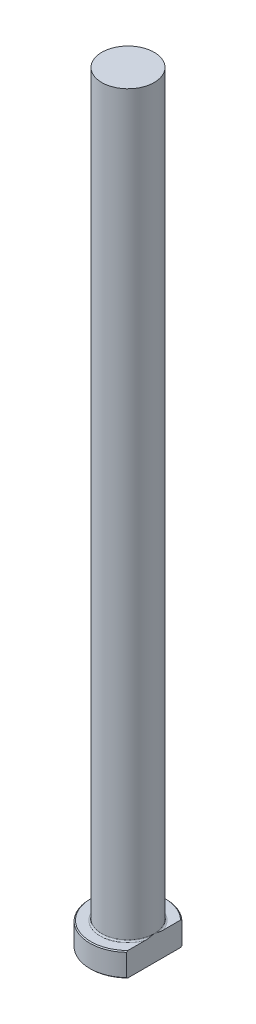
from build123d import *
from build123d.topology import SkipClean

# Parameters (mm, degrees)
CHAMFER1_SIZE = 0.2
FILLET1_R     = 0.3
KEY_DEPTH     = 161.399501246


with BuildPart() as part:
    # Sketch1 → Revolve1 (revolve)
    with BuildSketch(Plane.XY, mode=Mode.PRIVATE) as revolve1_sk:
        Polygon((0, 0), (-8, 0), (-8, 5), (-5.5, 5), (-5.5, 160), (0, 160), align=None)
    revolve(revolve1_sk.sketch.rotate(Axis((0, 259.958771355, 0), (0, -1, 0)), 270), axis=Axis((0, 259.958771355, 0), (0, -1, 0)))

    # Chamfer1
    chamfer1_edges = [part.edges().sort_by_distance(p)[0] for p in [
        (0, 5, -8),
        (0, 0, -8),
    ]]
    chamfer(chamfer1_edges, length=CHAMFER1_SIZE)

    # Fillet1
    fillet1_edges = [part.edges().sort_by_distance(p)[0] for p in [
        (0, 5, -5.5),
    ]]
    fillet(fillet1_edges, radius=FILLET1_R)

    # Sketch2 → KEY (cut, through all)
    with SkipClean():  # the faces are left unmerged after this step: merging them gives an invalid solid
        with BuildSketch(Plane(origin=(0, 0, 0), x_dir=(1, 0, 0), z_dir=(0, 1, 0))):
            with BuildLine():
                Line((5.5, 5.809475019), (5.5, -5.809475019))
                ThreePointArc((5.5, -5.809475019), (8, 0), (5.5, 5.809475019))
            make_face()
        extrude(amount=KEY_DEPTH, mode=Mode.SUBTRACT)


solid = part.part
